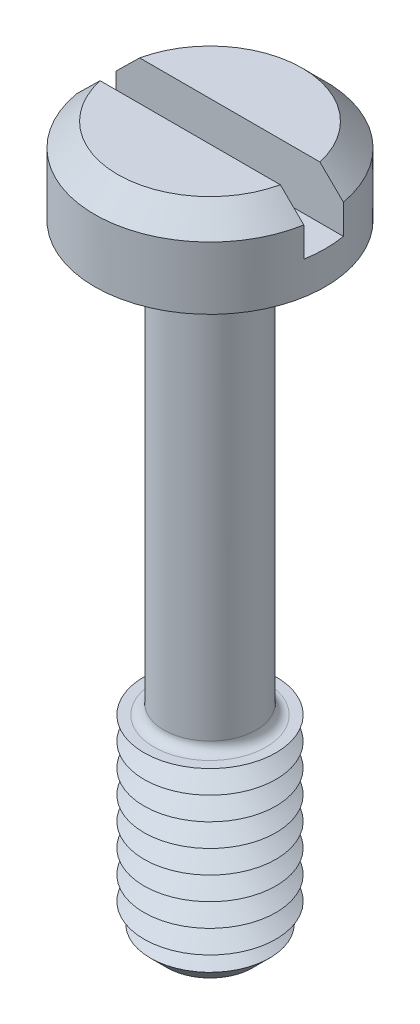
ISO-10303-21;
HEADER;
FILE_DESCRIPTION(('STEP AP214'),'2;1');
FILE_NAME('part.step','',(''),(''),'','','');
FILE_SCHEMA(('AUTOMOTIVE_DESIGN { 1 0 10303 214 1 1 1 1 }'));
ENDSEC;
DATA;
#1=APPLICATION_CONTEXT('core data for automotive mechanical design processes');
#2=APPLICATION_PROTOCOL_DEFINITION('international standard','automotive_design',2000,#1);
#3=PRODUCT_CONTEXT('',#1,'mechanical');
#4=PRODUCT('Part','Part','',(#3));
#5=PRODUCT_RELATED_PRODUCT_CATEGORY('part','',(#4));
#6=PRODUCT_DEFINITION_FORMATION('','',#4);
#7=PRODUCT_DEFINITION_CONTEXT('part definition',#1,'design');
#8=PRODUCT_DEFINITION('design','',#6,#7);
#9=PRODUCT_DEFINITION_SHAPE('','',#8);
#10=(LENGTH_UNIT() NAMED_UNIT(*) SI_UNIT(.MILLI.,.METRE.));
#11=(NAMED_UNIT(*) PLANE_ANGLE_UNIT() SI_UNIT($,.RADIAN.));
#12=(NAMED_UNIT(*) SI_UNIT($,.STERADIAN.) SOLID_ANGLE_UNIT());
#13=UNCERTAINTY_MEASURE_WITH_UNIT(LENGTH_MEASURE(1.E-05),#10,'distance_accuracy_value','');
#14=(GEOMETRIC_REPRESENTATION_CONTEXT(3) GLOBAL_UNCERTAINTY_ASSIGNED_CONTEXT((#13)) GLOBAL_UNIT_ASSIGNED_CONTEXT((#10,
#11,#12)) REPRESENTATION_CONTEXT('',''));
#15=CARTESIAN_POINT('',(0.,0.,0.));
#16=DIRECTION('',(0.,0.,1.));
#17=DIRECTION('',(1.,0.,0.));
#18=AXIS2_PLACEMENT_3D('',#15,#16,#17);
#19=CARTESIAN_POINT('',(0.,2.6,0.));
#20=DIRECTION('',(0.,1.,0.));
#21=DIRECTION('',(0.,0.,1.));
#22=AXIS2_PLACEMENT_3D('',#19,#20,#21);
#23=PLANE('',#22);
#24=DIRECTION('',(-1.,0.,0.));
#25=VECTOR('',#24,1.);
#26=CARTESIAN_POINT('',(3.5,2.6,-0.6));
#27=LINE('',#26,#25);
#28=CARTESIAN_POINT('',(2.73495886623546,2.6,-0.6));
#29=VERTEX_POINT('',#28);
#30=CARTESIAN_POINT('',(-2.73495886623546,2.6,-0.6));
#31=VERTEX_POINT('',#30);
#32=EDGE_CURVE('E110',#29,#31,#27,.T.);
#33=ORIENTED_EDGE('',*,*,#32,.F.);
#34=CARTESIAN_POINT('',(0.,2.6,0.));
#35=DIRECTION('',(0.,1.,0.));
#36=DIRECTION('',(0.,0.,1.));
#37=AXIS2_PLACEMENT_3D('',#34,#35,#36);
#38=CIRCLE('',#37,2.79999999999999);
#39=EDGE_CURVE('E113',#29,#31,#38,.T.);
#40=ORIENTED_EDGE('',*,*,#39,.T.);
#41=EDGE_LOOP('',(#33,#40));
#42=FACE_BOUND('',#41,.T.);
#43=ADVANCED_FACE('F39',(#42),#23,.T.);
#44=CARTESIAN_POINT('',(0.,2.6,0.));
#45=DIRECTION('',(0.,-1.,0.));
#46=DIRECTION('',(0.,0.,-1.));
#47=AXIS2_PLACEMENT_3D('',#44,#45,#46);
#48=CONICAL_SURFACE('',#47,2.79999999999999,0.785398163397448);
#49=CARTESIAN_POINT('',(7.69779986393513,-2.32114776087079,-0.6));
#50=CARTESIAN_POINT('',(7.42456340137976,-2.04874480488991,-0.6));
#51=CARTESIAN_POINT('',(7.15128998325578,-1.77637887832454,-0.6));
#52=CARTESIAN_POINT('',(6.60460779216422,-1.23176088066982,-0.6));
#53=CARTESIAN_POINT('',(6.33119901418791,-0.959508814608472,-0.6));
#54=CARTESIAN_POINT('',(5.78393918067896,-0.41491410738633,-0.6));
#55=CARTESIAN_POINT('',(5.51008795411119,-0.142571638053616,-0.6));
#56=CARTESIAN_POINT('',(4.9621249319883,0.401829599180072,-0.6));
#57=CARTESIAN_POINT('',(4.68801314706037,0.673888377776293,-0.6));
#58=CARTESIAN_POINT('',(4.15230810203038,1.204717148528,-0.6));
#59=CARTESIAN_POINT('',(3.89073524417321,1.4635077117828,-0.6));
#60=CARTESIAN_POINT('',(3.49781694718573,1.85115830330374,-0.6));
#61=CARTESIAN_POINT('',(3.36674319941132,1.98029362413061,-0.6));
#62=CARTESIAN_POINT('',(3.10433907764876,2.23830030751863,-0.6));
#63=CARTESIAN_POINT('',(2.97300870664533,2.36717167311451,-0.6));
#64=CARTESIAN_POINT('',(2.71005235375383,2.62445652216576,-0.6));
#65=CARTESIAN_POINT('',(2.57842659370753,2.75287023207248,-0.6));
#66=CARTESIAN_POINT('',(2.31459302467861,3.00911021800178,-0.6));
#67=CARTESIAN_POINT('',(2.1823851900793,3.13693646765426,-0.6));
#68=CARTESIAN_POINT('',(1.91706128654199,3.39159289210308,-0.6));
#69=CARTESIAN_POINT('',(1.78394541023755,3.51842326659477,-0.6));
#70=CARTESIAN_POINT('',(1.5829745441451,3.70728046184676,-0.6));
#71=CARTESIAN_POINT('',(1.51577053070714,3.76999922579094,-0.6));
#72=CARTESIAN_POINT('',(1.38073587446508,3.89475766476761,-0.6));
#73=CARTESIAN_POINT('',(1.31290524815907,3.95679735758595,-0.6));
#74=CARTESIAN_POINT('',(1.20662362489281,4.05253127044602,-0.6));
#75=CARTESIAN_POINT('',(1.16849592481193,4.08658409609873,-0.6));
#76=CARTESIAN_POINT('',(1.09186306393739,4.15427097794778,-0.6));
#77=CARTESIAN_POINT('',(1.05335786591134,4.18790499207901,-0.6));
#78=CARTESIAN_POINT('',(0.975560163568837,4.25487029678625,-0.6));
#79=CARTESIAN_POINT('',(0.936263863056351,4.28819718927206,-0.6));
#80=CARTESIAN_POINT('',(0.857023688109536,4.3540539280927,-0.6));
#81=CARTESIAN_POINT('',(0.817079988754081,4.38658398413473,-0.6));
#82=CARTESIAN_POINT('',(0.73593206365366,4.45080389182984,-0.6));
#83=CARTESIAN_POINT('',(0.694719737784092,4.48248357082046,-0.6));
#84=CARTESIAN_POINT('',(0.611023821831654,4.54411116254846,-0.6));
#85=CARTESIAN_POINT('',(0.568540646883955,4.5740596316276,-0.6));
#86=CARTESIAN_POINT('',(0.482031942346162,4.63104137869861,-0.6));
#87=CARTESIAN_POINT('',(0.438018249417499,4.65809235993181,-0.6));
#88=CARTESIAN_POINT('',(0.347545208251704,4.70764477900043,-0.6));
#89=CARTESIAN_POINT('',(0.301093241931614,4.73015905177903,-0.6));
#90=CARTESIAN_POINT('',(0.21684063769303,4.76288589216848,-0.6));
#91=CARTESIAN_POINT('',(0.179711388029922,4.77476119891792,-0.6));
#92=CARTESIAN_POINT('',(0.104069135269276,4.79214056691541,-0.6));
#93=CARTESIAN_POINT('',(0.0655630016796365,4.79767265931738,-0.6));
#94=CARTESIAN_POINT('',(-0.0121083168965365,4.80113734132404,-0.6));
#95=CARTESIAN_POINT('',(-0.051276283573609,4.7990121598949,-0.6));
#96=CARTESIAN_POINT('',(-0.128601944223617,4.78758103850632,-0.6));
#97=CARTESIAN_POINT('',(-0.166755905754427,4.77825158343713,-0.6));
#98=CARTESIAN_POINT('',(-0.239985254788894,4.75468984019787,-0.6));
#99=CARTESIAN_POINT('',(-0.275121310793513,4.74063623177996,-0.6));
#100=CARTESIAN_POINT('',(-0.343859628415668,4.70912771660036,-0.6));
#101=CARTESIAN_POINT('',(-0.377459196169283,4.69166709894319,-0.6));
#102=CARTESIAN_POINT('',(-0.443620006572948,4.65431398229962,-0.6));
#103=CARTESIAN_POINT('',(-0.476170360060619,4.63440256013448,-0.6));
#104=CARTESIAN_POINT('',(-0.540208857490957,4.5930114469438,-0.6));
#105=CARTESIAN_POINT('',(-0.571697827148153,4.57153301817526,-0.6));
#106=CARTESIAN_POINT('',(-0.63642661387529,4.52565712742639,-0.6));
#107=CARTESIAN_POINT('',(-0.669598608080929,4.50116466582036,-0.6));
#108=CARTESIAN_POINT('',(-0.735238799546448,4.4512509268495,-0.6));
#109=CARTESIAN_POINT('',(-0.767706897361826,4.4258295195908,-0.6));
#110=CARTESIAN_POINT('',(-0.864340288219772,4.34853769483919,-0.6));
#111=CARTESIAN_POINT('',(-0.927700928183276,4.29566444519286,-0.6));
#112=CARTESIAN_POINT('',(-1.05322030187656,4.18829389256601,-0.6));
#113=CARTESIAN_POINT('',(-1.11537654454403,4.13379371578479,-0.6));
#114=CARTESIAN_POINT('',(-1.23879800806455,4.02383276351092,-0.6));
#115=CARTESIAN_POINT('',(-1.30006349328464,3.96837228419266,-0.6));
#116=CARTESIAN_POINT('',(-1.42182653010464,3.85695373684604,-0.6));
#117=CARTESIAN_POINT('',(-1.48232573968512,3.8009974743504,-0.6));
#118=CARTESIAN_POINT('',(-1.60290045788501,3.68862177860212,-0.6));
#119=CARTESIAN_POINT('',(-1.66297593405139,3.63220231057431,-0.6));
#120=CARTESIAN_POINT('',(-1.84259490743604,3.46258196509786,-0.6));
#121=CARTESIAN_POINT('',(-1.96167258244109,3.34888831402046,-0.6));
#122=CARTESIAN_POINT('',(-2.19942862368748,3.12043467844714,-0.6));
#123=CARTESIAN_POINT('',(-2.31810499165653,3.00567262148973,-0.6));
#124=CARTESIAN_POINT('',(-2.55498513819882,2.77566147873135,-0.6));
#125=CARTESIAN_POINT('',(-2.67318891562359,2.66041239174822,-0.6));
#126=CARTESIAN_POINT('',(-3.0273377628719,2.31418176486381,-0.6));
#127=CARTESIAN_POINT('',(-3.26281496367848,2.08272206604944,-0.6));
#128=CARTESIAN_POINT('',(-3.73326607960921,1.6190281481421,-0.6));
#129=CARTESIAN_POINT('',(-3.96823963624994,1.38679356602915,-0.6));
#130=CARTESIAN_POINT('',(-4.43780370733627,0.921942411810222,-0.6));
#131=CARTESIAN_POINT('',(-4.67239422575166,0.689325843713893,-0.6));
#132=CARTESIAN_POINT('',(-5.13982382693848,0.225350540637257,-0.6));
#133=CARTESIAN_POINT('',(-5.37266445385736,-0.00600663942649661,-0.6));
#134=CARTESIAN_POINT('',(-5.83818541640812,-0.468883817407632,-0.6));
#135=CARTESIAN_POINT('',(-6.07086575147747,-0.700403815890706,-0.6));
#136=CARTESIAN_POINT('',(-6.53596926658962,-1.16341429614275,-0.6));
#137=CARTESIAN_POINT('',(-6.76839251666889,-1.39490470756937,-0.6));
#138=CARTESIAN_POINT('',(-7.23315324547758,-1.85796986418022,-0.6));
#139=CARTESIAN_POINT('',(-7.46549072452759,-2.08954460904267,-0.6));
#140=CARTESIAN_POINT('',(-7.69779986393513,-2.32114776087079,-0.6));
#141=B_SPLINE_CURVE_WITH_KNOTS('',3,(#49,#50,#51,#52,#53,#54,#55,#56,#57,#58,#59,#60,#61,#62,
#63,#64,#65,#66,#67,#68,#69,#70,#71,#72,#73,#74,#75,#76,#77,#78,#79,#80,#81,#82,#83,#84,#85,#86,
#87,#88,#89,#90,#91,#92,#93,#94,#95,#96,#97,#98,#99,#100,#101,#102,#103,#104,#105,#106,#107,
#108,#109,#110,#111,#112,#113,#114,#115,#116,#117,#118,#119,#120,#121,#122,#123,#124,#125,#126,
#127,#128,#129,#130,#131,#132,#133,#134,#135,#136,#137,#138,#139,#140),.UNSPECIFIED.,.F.,.F.,(4,
2,2,2,2,2,2,2,2,2,2,2,2,2,2,2,2,2,2,2,2,2,2,2,2,2,2,2,2,2,2,2,2,2,2,2,2,2,2,2,2,2,2,2,2,4),(0.,
1.15747738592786,2.31500139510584,3.4736574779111,4.63226817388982,5.73614050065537,
6.28814234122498,6.84013779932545,7.39180548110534,7.94349768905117,8.49507629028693,
8.77084567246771,9.04660781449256,9.19996738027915,9.35334222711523,9.50791164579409,
9.66243993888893,9.81835637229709,9.9742224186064,10.1290741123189,10.2834813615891,
10.4000294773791,10.5160605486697,10.6329688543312,10.7502603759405,10.8635386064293,
10.9770083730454,11.0914168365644,11.205734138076,11.3294140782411,11.4531113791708,
11.7006314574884,11.9486181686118,12.1965297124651,12.4437540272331,12.6909970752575,
13.184904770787,13.6801705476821,14.1754375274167,15.1659939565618,16.1571087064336,
17.1482131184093,18.1329303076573,19.1176509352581,20.1017623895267,21.0858701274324),.UNSPECIFIED.);
#142=CARTESIAN_POINT('',(3.44818792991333,1.89999999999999,-0.6));
#143=VERTEX_POINT('',#142);
#144=EDGE_CURVE('E260',#143,#29,#141,.T.);
#145=ORIENTED_EDGE('',*,*,#144,.F.);
#146=CARTESIAN_POINT('',(0.,1.89999999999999,0.));
#147=DIRECTION('',(0.,1.,0.));
#148=DIRECTION('',(0.,0.,1.));
#149=AXIS2_PLACEMENT_3D('',#146,#147,#148);
#150=CIRCLE('',#149,3.5);
#151=CARTESIAN_POINT('',(-3.44818792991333,1.89999999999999,-0.6));
#152=VERTEX_POINT('',#151);
#153=EDGE_CURVE('E128',#152,#143,#150,.F.);
#154=ORIENTED_EDGE('',*,*,#153,.F.);
#155=EDGE_CURVE('E102',#31,#152,#141,.T.);
#156=ORIENTED_EDGE('',*,*,#155,.F.);
#157=ORIENTED_EDGE('',*,*,#39,.F.);
#158=EDGE_LOOP('',(#145,#154,#156,#157));
#159=FACE_BOUND('',#158,.T.);
#160=ADVANCED_FACE('F222',(#159),#48,.T.);
#161=CARTESIAN_POINT('',(0.,-19.,0.));
#162=DIRECTION('',(0.,1.,0.));
#163=DIRECTION('',(0.,0.,1.));
#164=AXIS2_PLACEMENT_3D('',#161,#162,#163);
#165=CYLINDRICAL_SURFACE('',#164,1.4);
#166=CARTESIAN_POINT('',(0.,-12.7,0.));
#167=DIRECTION('',(0.,-1.,0.));
#168=DIRECTION('',(0.,0.,-1.));
#169=AXIS2_PLACEMENT_3D('',#166,#167,#168);
#170=CIRCLE('',#169,1.4);
#171=CARTESIAN_POINT('',(0.,-12.7,-1.4));
#172=VERTEX_POINT('',#171);
#173=EDGE_CURVE('E123',#172,#172,#170,.F.);
#174=ORIENTED_EDGE('',*,*,#173,.T.);
#175=EDGE_LOOP('',(#174));
#176=FACE_BOUND('',#175,.T.);
#177=CARTESIAN_POINT('',(0.,-0.300000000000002,0.));
#178=DIRECTION('',(0.,1.,0.));
#179=DIRECTION('',(0.,0.,1.));
#180=AXIS2_PLACEMENT_3D('',#177,#178,#179);
#181=CIRCLE('',#180,1.4);
#182=CARTESIAN_POINT('',(0.,-0.300000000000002,1.4));
#183=VERTEX_POINT('',#182);
#184=EDGE_CURVE('E366',#183,#183,#181,.F.);
#185=ORIENTED_EDGE('',*,*,#184,.T.);
#186=EDGE_LOOP('',(#185));
#187=FACE_BOUND('',#186,.T.);
#188=ADVANCED_FACE('F218',(#176,#187),#165,.T.);
#189=CARTESIAN_POINT('',(0.,2.6,0.));
#190=DIRECTION('',(0.,-1.,0.));
#191=DIRECTION('',(0.,0.,-1.));
#192=AXIS2_PLACEMENT_3D('',#189,#190,#191);
#193=CYLINDRICAL_SURFACE('',#192,3.5);
#194=ORIENTED_EDGE('',*,*,#153,.T.);
#195=DIRECTION('',(0.,-1.,0.));
#196=VECTOR('',#195,1.);
#197=CARTESIAN_POINT('',(3.44818792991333,2.6,-0.6));
#198=LINE('',#197,#196);
#199=CARTESIAN_POINT('',(3.44818792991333,1.,-0.6));
#200=VERTEX_POINT('',#199);
#201=EDGE_CURVE('E64',#143,#200,#198,.T.);
#202=ORIENTED_EDGE('',*,*,#201,.T.);
#203=CARTESIAN_POINT('',(0.,1.,0.));
#204=DIRECTION('',(0.,1.,0.));
#205=DIRECTION('',(0.,0.,1.));
#206=AXIS2_PLACEMENT_3D('',#203,#204,#205);
#207=CIRCLE('',#206,3.5);
#208=CARTESIAN_POINT('',(3.44818792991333,1.,0.6));
#209=VERTEX_POINT('',#208);
#210=EDGE_CURVE('E11',#209,#200,#207,.T.);
#211=ORIENTED_EDGE('',*,*,#210,.F.);
#212=DIRECTION('',(0.,-1.,0.));
#213=VECTOR('',#212,1.);
#214=CARTESIAN_POINT('',(3.44818792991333,2.6,0.6));
#215=LINE('',#214,#213);
#216=CARTESIAN_POINT('',(3.44818792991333,1.89999999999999,0.6));
#217=VERTEX_POINT('',#216);
#218=EDGE_CURVE('E279',#209,#217,#215,.F.);
#219=ORIENTED_EDGE('',*,*,#218,.T.);
#220=CARTESIAN_POINT('',(-3.44818792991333,1.89999999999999,0.6));
#221=VERTEX_POINT('',#220);
#222=EDGE_CURVE('E120',#217,#221,#150,.F.);
#223=ORIENTED_EDGE('',*,*,#222,.T.);
#224=DIRECTION('',(0.,-1.,0.));
#225=VECTOR('',#224,1.);
#226=CARTESIAN_POINT('',(-3.44818792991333,2.6,0.6));
#227=LINE('',#226,#225);
#228=CARTESIAN_POINT('',(-3.44818792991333,1.,0.6));
#229=VERTEX_POINT('',#228);
#230=EDGE_CURVE('E96',#221,#229,#227,.T.);
#231=ORIENTED_EDGE('',*,*,#230,.T.);
#232=CARTESIAN_POINT('',(-3.44818792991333,1.,-0.6));
#233=VERTEX_POINT('',#232);
#234=EDGE_CURVE('E44',#233,#229,#207,.T.);
#235=ORIENTED_EDGE('',*,*,#234,.F.);
#236=DIRECTION('',(0.,-1.,0.));
#237=VECTOR('',#236,1.);
#238=CARTESIAN_POINT('',(-3.44818792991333,2.6,-0.6));
#239=LINE('',#238,#237);
#240=EDGE_CURVE('E283',#233,#152,#239,.F.);
#241=ORIENTED_EDGE('',*,*,#240,.T.);
#242=EDGE_LOOP('',(#194,#202,#211,#219,#223,#231,#235,#241));
#243=FACE_BOUND('',#242,.T.);
#244=CARTESIAN_POINT('',(0.,0.,0.));
#245=DIRECTION('',(0.,1.,0.));
#246=DIRECTION('',(0.,0.,1.));
#247=AXIS2_PLACEMENT_3D('',#244,#245,#246);
#248=CIRCLE('',#247,3.5);
#249=CARTESIAN_POINT('',(0.,0.,3.5));
#250=VERTEX_POINT('',#249);
#251=EDGE_CURVE('E353',#250,#250,#248,.T.);
#252=ORIENTED_EDGE('',*,*,#251,.T.);
#253=EDGE_LOOP('',(#252));
#254=FACE_BOUND('',#253,.T.);
#255=ADVANCED_FACE('F221',(#243,#254),#193,.T.);
#256=DIRECTION('',(1.,0.,0.));
#257=VECTOR('',#256,1.);
#258=CARTESIAN_POINT('',(3.5,2.6,0.6));
#259=LINE('',#258,#257);
#260=CARTESIAN_POINT('',(-2.73495886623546,2.6,0.6));
#261=VERTEX_POINT('',#260);
#262=CARTESIAN_POINT('',(2.73495886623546,2.6,0.6));
#263=VERTEX_POINT('',#262);
#264=EDGE_CURVE('E56',#261,#263,#259,.T.);
#265=ORIENTED_EDGE('',*,*,#264,.F.);
#266=EDGE_CURVE('E108',#261,#263,#38,.T.);
#267=ORIENTED_EDGE('',*,*,#266,.T.);
#268=EDGE_LOOP('',(#265,#267));
#269=FACE_BOUND('',#268,.T.);
#270=ADVANCED_FACE('F107',(#269),#23,.T.);
#271=CARTESIAN_POINT('',(0.,0.,0.));
#272=DIRECTION('',(0.,1.,0.));
#273=DIRECTION('',(0.,0.,1.));
#274=AXIS2_PLACEMENT_3D('',#271,#272,#273);
#275=PLANE('',#274);
#276=CARTESIAN_POINT('',(0.,0.,0.));
#277=DIRECTION('',(0.,1.,0.));
#278=DIRECTION('',(0.,0.,1.));
#279=AXIS2_PLACEMENT_3D('',#276,#277,#278);
#280=CIRCLE('',#279,1.7);
#281=CARTESIAN_POINT('',(0.,0.,1.7));
#282=VERTEX_POINT('',#281);
#283=EDGE_CURVE('E114',#282,#282,#280,.T.);
#284=ORIENTED_EDGE('',*,*,#283,.T.);
#285=EDGE_LOOP('',(#284));
#286=FACE_BOUND('',#285,.T.);
#287=ORIENTED_EDGE('',*,*,#251,.F.);
#288=EDGE_LOOP('',(#287));
#289=FACE_BOUND('',#288,.T.);
#290=ADVANCED_FACE('F212',(#286,#289),#275,.F.);
#291=CARTESIAN_POINT('',(0.,-13.,0.));
#292=DIRECTION('',(0.,-1.,0.));
#293=DIRECTION('',(0.,0.,-1.));
#294=AXIS2_PLACEMENT_3D('',#291,#292,#293);
#295=PLANE('',#294);
#296=CARTESIAN_POINT('',(0.,-13.,0.));
#297=DIRECTION('',(0.,-1.,0.));
#298=DIRECTION('',(0.,0.,-1.));
#299=AXIS2_PLACEMENT_3D('',#296,#297,#298);
#300=CIRCLE('',#299,1.7);
#301=CARTESIAN_POINT('',(0.,-13.,-1.7));
#302=VERTEX_POINT('',#301);
#303=EDGE_CURVE('E360',#302,#302,#300,.T.);
#304=ORIENTED_EDGE('',*,*,#303,.T.);
#305=EDGE_LOOP('',(#304));
#306=FACE_BOUND('',#305,.T.);
#307=CARTESIAN_POINT('',(0.,-13.,0.));
#308=DIRECTION('',(0.,1.,0.));
#309=DIRECTION('',(0.,0.,1.));
#310=AXIS2_PLACEMENT_3D('',#307,#308,#309);
#311=CIRCLE('',#310,2.);
#312=CARTESIAN_POINT('',(0.,-13.,2.));
#313=VERTEX_POINT('',#312);
#314=EDGE_CURVE('E349',#313,#313,#311,.T.);
#315=ORIENTED_EDGE('',*,*,#314,.T.);
#316=EDGE_LOOP('',(#315));
#317=FACE_BOUND('',#316,.T.);
#318=ADVANCED_FACE('F208',(#306,#317),#295,.F.);
#319=CARTESIAN_POINT('',(0.,-13.35,0.));
#320=DIRECTION('',(0.,1.,0.));
#321=DIRECTION('',(0.,0.,1.));
#322=AXIS2_PLACEMENT_3D('',#319,#320,#321);
#323=CONICAL_SURFACE('',#322,1.39378221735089,1.0471975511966);
#324=ORIENTED_EDGE('',*,*,#314,.F.);
#325=EDGE_LOOP('',(#324));
#326=FACE_BOUND('',#325,.T.);
#327=CARTESIAN_POINT('',(0.,-13.35,0.));
#328=DIRECTION('',(0.,1.,0.));
#329=DIRECTION('',(0.,0.,1.));
#330=AXIS2_PLACEMENT_3D('',#327,#328,#329);
#331=CIRCLE('',#330,1.39378221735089);
#332=CARTESIAN_POINT('',(0.,-13.35,1.39378221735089));
#333=VERTEX_POINT('',#332);
#334=EDGE_CURVE('E346',#333,#333,#331,.T.);
#335=ORIENTED_EDGE('',*,*,#334,.T.);
#336=EDGE_LOOP('',(#335));
#337=FACE_BOUND('',#336,.T.);
#338=ADVANCED_FACE('F204',(#326,#337),#323,.T.);
#339=CARTESIAN_POINT('',(0.,-13.7,0.));
#340=DIRECTION('',(0.,-1.,0.));
#341=DIRECTION('',(0.,0.,-1.));
#342=AXIS2_PLACEMENT_3D('',#339,#340,#341);
#343=CONICAL_SURFACE('',#342,2.,1.0471975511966);
#344=ORIENTED_EDGE('',*,*,#334,.F.);
#345=EDGE_LOOP('',(#344));
#346=FACE_BOUND('',#345,.T.);
#347=CARTESIAN_POINT('',(0.,-13.7,0.));
#348=DIRECTION('',(0.,1.,0.));
#349=DIRECTION('',(0.,0.,1.));
#350=AXIS2_PLACEMENT_3D('',#347,#348,#349);
#351=CIRCLE('',#350,2.);
#352=CARTESIAN_POINT('',(0.,-13.7,2.));
#353=VERTEX_POINT('',#352);
#354=EDGE_CURVE('E342',#353,#353,#351,.T.);
#355=ORIENTED_EDGE('',*,*,#354,.T.);
#356=EDGE_LOOP('',(#355));
#357=FACE_BOUND('',#356,.T.);
#358=ADVANCED_FACE('F200',(#346,#357),#343,.T.);
#359=CARTESIAN_POINT('',(0.,-14.05,0.));
#360=DIRECTION('',(0.,1.,0.));
#361=DIRECTION('',(0.,0.,1.));
#362=AXIS2_PLACEMENT_3D('',#359,#360,#361);
#363=CONICAL_SURFACE('',#362,1.39378221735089,1.0471975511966);
#364=ORIENTED_EDGE('',*,*,#354,.F.);
#365=EDGE_LOOP('',(#364));
#366=FACE_BOUND('',#365,.T.);
#367=CARTESIAN_POINT('',(0.,-14.05,0.));
#368=DIRECTION('',(0.,1.,0.));
#369=DIRECTION('',(0.,0.,1.));
#370=AXIS2_PLACEMENT_3D('',#367,#368,#369);
#371=CIRCLE('',#370,1.39378221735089);
#372=CARTESIAN_POINT('',(0.,-14.05,1.39378221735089));
#373=VERTEX_POINT('',#372);
#374=EDGE_CURVE('E338',#373,#373,#371,.T.);
#375=ORIENTED_EDGE('',*,*,#374,.T.);
#376=EDGE_LOOP('',(#375));
#377=FACE_BOUND('',#376,.T.);
#378=ADVANCED_FACE('F196',(#366,#377),#363,.T.);
#379=CARTESIAN_POINT('',(0.,-14.4,0.));
#380=DIRECTION('',(0.,-1.,0.));
#381=DIRECTION('',(0.,0.,-1.));
#382=AXIS2_PLACEMENT_3D('',#379,#380,#381);
#383=CONICAL_SURFACE('',#382,2.,1.0471975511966);
#384=ORIENTED_EDGE('',*,*,#374,.F.);
#385=EDGE_LOOP('',(#384));
#386=FACE_BOUND('',#385,.T.);
#387=CARTESIAN_POINT('',(0.,-14.4,0.));
#388=DIRECTION('',(0.,1.,0.));
#389=DIRECTION('',(0.,0.,1.));
#390=AXIS2_PLACEMENT_3D('',#387,#388,#389);
#391=CIRCLE('',#390,2.);
#392=CARTESIAN_POINT('',(0.,-14.4,2.));
#393=VERTEX_POINT('',#392);
#394=EDGE_CURVE('E334',#393,#393,#391,.T.);
#395=ORIENTED_EDGE('',*,*,#394,.T.);
#396=EDGE_LOOP('',(#395));
#397=FACE_BOUND('',#396,.T.);
#398=ADVANCED_FACE('F192',(#386,#397),#383,.T.);
#399=CARTESIAN_POINT('',(0.,-14.75,0.));
#400=DIRECTION('',(0.,1.,0.));
#401=DIRECTION('',(0.,0.,1.));
#402=AXIS2_PLACEMENT_3D('',#399,#400,#401);
#403=CONICAL_SURFACE('',#402,1.39378221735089,1.0471975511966);
#404=ORIENTED_EDGE('',*,*,#394,.F.);
#405=EDGE_LOOP('',(#404));
#406=FACE_BOUND('',#405,.T.);
#407=CARTESIAN_POINT('',(0.,-14.75,0.));
#408=DIRECTION('',(0.,1.,0.));
#409=DIRECTION('',(0.,0.,1.));
#410=AXIS2_PLACEMENT_3D('',#407,#408,#409);
#411=CIRCLE('',#410,1.39378221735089);
#412=CARTESIAN_POINT('',(0.,-14.75,1.39378221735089));
#413=VERTEX_POINT('',#412);
#414=EDGE_CURVE('E330',#413,#413,#411,.T.);
#415=ORIENTED_EDGE('',*,*,#414,.T.);
#416=EDGE_LOOP('',(#415));
#417=FACE_BOUND('',#416,.T.);
#418=ADVANCED_FACE('F188',(#406,#417),#403,.T.);
#419=CARTESIAN_POINT('',(0.,-15.1,0.));
#420=DIRECTION('',(0.,-1.,0.));
#421=DIRECTION('',(0.,0.,-1.));
#422=AXIS2_PLACEMENT_3D('',#419,#420,#421);
#423=CONICAL_SURFACE('',#422,2.,1.0471975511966);
#424=ORIENTED_EDGE('',*,*,#414,.F.);
#425=EDGE_LOOP('',(#424));
#426=FACE_BOUND('',#425,.T.);
#427=CARTESIAN_POINT('',(0.,-15.1,0.));
#428=DIRECTION('',(0.,1.,0.));
#429=DIRECTION('',(0.,0.,1.));
#430=AXIS2_PLACEMENT_3D('',#427,#428,#429);
#431=CIRCLE('',#430,2.);
#432=CARTESIAN_POINT('',(0.,-15.1,2.));
#433=VERTEX_POINT('',#432);
#434=EDGE_CURVE('E326',#433,#433,#431,.T.);
#435=ORIENTED_EDGE('',*,*,#434,.T.);
#436=EDGE_LOOP('',(#435));
#437=FACE_BOUND('',#436,.T.);
#438=ADVANCED_FACE('F184',(#426,#437),#423,.T.);
#439=CARTESIAN_POINT('',(0.,-15.45,0.));
#440=DIRECTION('',(0.,1.,0.));
#441=DIRECTION('',(0.,0.,1.));
#442=AXIS2_PLACEMENT_3D('',#439,#440,#441);
#443=CONICAL_SURFACE('',#442,1.39378221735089,1.0471975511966);
#444=ORIENTED_EDGE('',*,*,#434,.F.);
#445=EDGE_LOOP('',(#444));
#446=FACE_BOUND('',#445,.T.);
#447=CARTESIAN_POINT('',(0.,-15.45,0.));
#448=DIRECTION('',(0.,1.,0.));
#449=DIRECTION('',(0.,0.,1.));
#450=AXIS2_PLACEMENT_3D('',#447,#448,#449);
#451=CIRCLE('',#450,1.39378221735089);
#452=CARTESIAN_POINT('',(0.,-15.45,1.39378221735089));
#453=VERTEX_POINT('',#452);
#454=EDGE_CURVE('E323',#453,#453,#451,.T.);
#455=ORIENTED_EDGE('',*,*,#454,.T.);
#456=EDGE_LOOP('',(#455));
#457=FACE_BOUND('',#456,.T.);
#458=ADVANCED_FACE('F180',(#446,#457),#443,.T.);
#459=CARTESIAN_POINT('',(0.,-15.8,0.));
#460=DIRECTION('',(0.,-1.,0.));
#461=DIRECTION('',(0.,0.,-1.));
#462=AXIS2_PLACEMENT_3D('',#459,#460,#461);
#463=CONICAL_SURFACE('',#462,2.,1.0471975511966);
#464=ORIENTED_EDGE('',*,*,#454,.F.);
#465=EDGE_LOOP('',(#464));
#466=FACE_BOUND('',#465,.T.);
#467=CARTESIAN_POINT('',(0.,-15.8,0.));
#468=DIRECTION('',(0.,1.,0.));
#469=DIRECTION('',(0.,0.,1.));
#470=AXIS2_PLACEMENT_3D('',#467,#468,#469);
#471=CIRCLE('',#470,2.);
#472=CARTESIAN_POINT('',(0.,-15.8,2.));
#473=VERTEX_POINT('',#472);
#474=EDGE_CURVE('E319',#473,#473,#471,.T.);
#475=ORIENTED_EDGE('',*,*,#474,.T.);
#476=EDGE_LOOP('',(#475));
#477=FACE_BOUND('',#476,.T.);
#478=ADVANCED_FACE('F176',(#466,#477),#463,.T.);
#479=CARTESIAN_POINT('',(0.,-16.15,0.));
#480=DIRECTION('',(0.,1.,0.));
#481=DIRECTION('',(0.,0.,1.));
#482=AXIS2_PLACEMENT_3D('',#479,#480,#481);
#483=CONICAL_SURFACE('',#482,1.39378221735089,1.0471975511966);
#484=ORIENTED_EDGE('',*,*,#474,.F.);
#485=EDGE_LOOP('',(#484));
#486=FACE_BOUND('',#485,.T.);
#487=CARTESIAN_POINT('',(0.,-16.15,0.));
#488=DIRECTION('',(0.,1.,0.));
#489=DIRECTION('',(0.,0.,1.));
#490=AXIS2_PLACEMENT_3D('',#487,#488,#489);
#491=CIRCLE('',#490,1.39378221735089);
#492=CARTESIAN_POINT('',(0.,-16.15,1.39378221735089));
#493=VERTEX_POINT('',#492);
#494=EDGE_CURVE('E315',#493,#493,#491,.T.);
#495=ORIENTED_EDGE('',*,*,#494,.T.);
#496=EDGE_LOOP('',(#495));
#497=FACE_BOUND('',#496,.T.);
#498=ADVANCED_FACE('F172',(#486,#497),#483,.T.);
#499=CARTESIAN_POINT('',(0.,-16.5,0.));
#500=DIRECTION('',(0.,-1.,0.));
#501=DIRECTION('',(0.,0.,-1.));
#502=AXIS2_PLACEMENT_3D('',#499,#500,#501);
#503=CONICAL_SURFACE('',#502,2.,1.0471975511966);
#504=ORIENTED_EDGE('',*,*,#494,.F.);
#505=EDGE_LOOP('',(#504));
#506=FACE_BOUND('',#505,.T.);
#507=CARTESIAN_POINT('',(0.,-16.5,0.));
#508=DIRECTION('',(0.,1.,0.));
#509=DIRECTION('',(0.,0.,1.));
#510=AXIS2_PLACEMENT_3D('',#507,#508,#509);
#511=CIRCLE('',#510,2.);
#512=CARTESIAN_POINT('',(0.,-16.5,2.));
#513=VERTEX_POINT('',#512);
#514=EDGE_CURVE('E312',#513,#513,#511,.T.);
#515=ORIENTED_EDGE('',*,*,#514,.T.);
#516=EDGE_LOOP('',(#515));
#517=FACE_BOUND('',#516,.T.);
#518=ADVANCED_FACE('F168',(#506,#517),#503,.T.);
#519=CARTESIAN_POINT('',(0.,-16.85,0.));
#520=DIRECTION('',(0.,1.,0.));
#521=DIRECTION('',(0.,0.,1.));
#522=AXIS2_PLACEMENT_3D('',#519,#520,#521);
#523=CONICAL_SURFACE('',#522,1.39378221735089,1.0471975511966);
#524=ORIENTED_EDGE('',*,*,#514,.F.);
#525=EDGE_LOOP('',(#524));
#526=FACE_BOUND('',#525,.T.);
#527=CARTESIAN_POINT('',(0.,-16.85,0.));
#528=DIRECTION('',(0.,1.,0.));
#529=DIRECTION('',(0.,0.,1.));
#530=AXIS2_PLACEMENT_3D('',#527,#528,#529);
#531=CIRCLE('',#530,1.39378221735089);
#532=CARTESIAN_POINT('',(0.,-16.85,1.39378221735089));
#533=VERTEX_POINT('',#532);
#534=EDGE_CURVE('E308',#533,#533,#531,.T.);
#535=ORIENTED_EDGE('',*,*,#534,.T.);
#536=EDGE_LOOP('',(#535));
#537=FACE_BOUND('',#536,.T.);
#538=ADVANCED_FACE('F164',(#526,#537),#523,.T.);
#539=CARTESIAN_POINT('',(0.,-17.2,0.));
#540=DIRECTION('',(0.,-1.,0.));
#541=DIRECTION('',(0.,0.,-1.));
#542=AXIS2_PLACEMENT_3D('',#539,#540,#541);
#543=CONICAL_SURFACE('',#542,2.,1.0471975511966);
#544=ORIENTED_EDGE('',*,*,#534,.F.);
#545=EDGE_LOOP('',(#544));
#546=FACE_BOUND('',#545,.T.);
#547=CARTESIAN_POINT('',(0.,-17.2,0.));
#548=DIRECTION('',(0.,1.,0.));
#549=DIRECTION('',(0.,0.,1.));
#550=AXIS2_PLACEMENT_3D('',#547,#548,#549);
#551=CIRCLE('',#550,2.);
#552=CARTESIAN_POINT('',(0.,-17.2,2.));
#553=VERTEX_POINT('',#552);
#554=EDGE_CURVE('E305',#553,#553,#551,.T.);
#555=ORIENTED_EDGE('',*,*,#554,.T.);
#556=EDGE_LOOP('',(#555));
#557=FACE_BOUND('',#556,.T.);
#558=ADVANCED_FACE('F160',(#546,#557),#543,.T.);
#559=CARTESIAN_POINT('',(0.,-17.55,0.));
#560=DIRECTION('',(0.,1.,0.));
#561=DIRECTION('',(0.,0.,1.));
#562=AXIS2_PLACEMENT_3D('',#559,#560,#561);
#563=CONICAL_SURFACE('',#562,1.39378221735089,1.0471975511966);
#564=ORIENTED_EDGE('',*,*,#554,.F.);
#565=EDGE_LOOP('',(#564));
#566=FACE_BOUND('',#565,.T.);
#567=CARTESIAN_POINT('',(0.,-17.55,0.));
#568=DIRECTION('',(0.,1.,0.));
#569=DIRECTION('',(0.,0.,1.));
#570=AXIS2_PLACEMENT_3D('',#567,#568,#569);
#571=CIRCLE('',#570,1.39378221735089);
#572=CARTESIAN_POINT('',(0.,-17.55,1.39378221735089));
#573=VERTEX_POINT('',#572);
#574=EDGE_CURVE('E301',#573,#573,#571,.T.);
#575=ORIENTED_EDGE('',*,*,#574,.T.);
#576=EDGE_LOOP('',(#575));
#577=FACE_BOUND('',#576,.T.);
#578=ADVANCED_FACE('F156',(#566,#577),#563,.T.);
#579=CARTESIAN_POINT('',(0.,-17.9,0.));
#580=DIRECTION('',(0.,-1.,0.));
#581=DIRECTION('',(0.,0.,-1.));
#582=AXIS2_PLACEMENT_3D('',#579,#580,#581);
#583=CONICAL_SURFACE('',#582,2.,1.0471975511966);
#584=ORIENTED_EDGE('',*,*,#574,.F.);
#585=EDGE_LOOP('',(#584));
#586=FACE_BOUND('',#585,.T.);
#587=CARTESIAN_POINT('',(0.,-17.9,0.));
#588=DIRECTION('',(0.,1.,0.));
#589=DIRECTION('',(0.,0.,1.));
#590=AXIS2_PLACEMENT_3D('',#587,#588,#589);
#591=CIRCLE('',#590,2.);
#592=CARTESIAN_POINT('',(0.,-17.9,2.));
#593=VERTEX_POINT('',#592);
#594=EDGE_CURVE('E296',#593,#593,#591,.T.);
#595=ORIENTED_EDGE('',*,*,#594,.T.);
#596=EDGE_LOOP('',(#595));
#597=FACE_BOUND('',#596,.T.);
#598=ADVANCED_FACE('F152',(#586,#597),#583,.T.);
#599=CARTESIAN_POINT('',(0.,-18.25,0.));
#600=DIRECTION('',(0.,1.,0.));
#601=DIRECTION('',(0.,0.,1.));
#602=AXIS2_PLACEMENT_3D('',#599,#600,#601);
#603=CONICAL_SURFACE('',#602,1.39378221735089,1.0471975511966);
#604=ORIENTED_EDGE('',*,*,#594,.F.);
#605=EDGE_LOOP('',(#604));
#606=FACE_BOUND('',#605,.T.);
#607=CARTESIAN_POINT('',(0.,-18.25,0.));
#608=DIRECTION('',(0.,1.,0.));
#609=DIRECTION('',(0.,0.,1.));
#610=AXIS2_PLACEMENT_3D('',#607,#608,#609);
#611=CIRCLE('',#610,1.39378221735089);
#612=CARTESIAN_POINT('',(0.,-18.25,1.39378221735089));
#613=VERTEX_POINT('',#612);
#614=EDGE_CURVE('E293',#613,#613,#611,.T.);
#615=ORIENTED_EDGE('',*,*,#614,.T.);
#616=EDGE_LOOP('',(#615));
#617=FACE_BOUND('',#616,.T.);
#618=ADVANCED_FACE('F148',(#606,#617),#603,.T.);
#619=CARTESIAN_POINT('',(0.,-18.6,0.));
#620=DIRECTION('',(0.,-1.,0.));
#621=DIRECTION('',(0.,0.,-1.));
#622=AXIS2_PLACEMENT_3D('',#619,#620,#621);
#623=CONICAL_SURFACE('',#622,2.,1.0471975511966);
#624=CARTESIAN_POINT('',(0.,-18.4901923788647,0.));
#625=DIRECTION('',(0.,-1.,0.));
#626=DIRECTION('',(0.,0.,-1.));
#627=AXIS2_PLACEMENT_3D('',#624,#625,#626);
#628=CIRCLE('',#627,1.80980762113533);
#629=CARTESIAN_POINT('',(0.,-18.4901923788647,1.80980762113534));
#630=VERTEX_POINT('',#629);
#631=EDGE_CURVE('E300',#630,#630,#628,.F.);
#632=ORIENTED_EDGE('',*,*,#631,.T.);
#633=EDGE_LOOP('',(#632));
#634=FACE_BOUND('',#633,.T.);
#635=ORIENTED_EDGE('',*,*,#614,.F.);
#636=EDGE_LOOP('',(#635));
#637=FACE_BOUND('',#636,.T.);
#638=ADVANCED_FACE('F144',(#634,#637),#623,.T.);
#639=CARTESIAN_POINT('',(0.,-19.,0.));
#640=DIRECTION('',(0.,-1.,0.));
#641=DIRECTION('',(0.,0.,-1.));
#642=AXIS2_PLACEMENT_3D('',#639,#640,#641);
#643=PLANE('',#642);
#644=CARTESIAN_POINT('',(0.,-19.,0.));
#645=DIRECTION('',(0.,-1.,0.));
#646=DIRECTION('',(0.,0.,-1.));
#647=AXIS2_PLACEMENT_3D('',#644,#645,#646);
#648=CIRCLE('',#647,1.30000000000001);
#649=CARTESIAN_POINT('',(0.,-19.,1.30000000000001));
#650=VERTEX_POINT('',#649);
#651=EDGE_CURVE('E356',#650,#650,#648,.T.);
#652=ORIENTED_EDGE('',*,*,#651,.T.);
#653=EDGE_LOOP('',(#652));
#654=FACE_BOUND('',#653,.T.);
#655=ADVANCED_FACE('F147',(#654),#643,.T.);
#656=CARTESIAN_POINT('',(0.,-19.,0.));
#657=DIRECTION('',(0.,1.,0.));
#658=DIRECTION('',(0.,0.,1.));
#659=AXIS2_PLACEMENT_3D('',#656,#657,#658);
#660=CONICAL_SURFACE('',#659,1.30000000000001,0.785398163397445);
#661=CARTESIAN_POINT('',(0.,-18.4901923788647,1.80980762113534));
#662=CARTESIAN_POINT('',(0.,-18.4955028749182,1.80449712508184));
#663=CARTESIAN_POINT('',(0.,-18.5008133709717,1.79918662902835));
#664=CARTESIAN_POINT('',(0.,-18.5114343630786,1.78856563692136));
#665=CARTESIAN_POINT('',(0.,-18.5167448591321,1.78325514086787));
#666=CARTESIAN_POINT('',(0.,-18.5273658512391,1.77263414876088));
#667=CARTESIAN_POINT('',(0.,-18.5326763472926,1.76732365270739));
#668=CARTESIAN_POINT('',(0.,-18.5432973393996,1.75670266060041));
#669=CARTESIAN_POINT('',(0.,-18.5486078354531,1.75139216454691));
#670=CARTESIAN_POINT('',(0.,-18.5592288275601,1.74077117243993));
#671=CARTESIAN_POINT('',(0.,-18.5645393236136,1.73546067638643));
#672=CARTESIAN_POINT('',(0.,-18.5751603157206,1.72483968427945));
#673=CARTESIAN_POINT('',(0.,-18.580470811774,1.71952918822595));
#674=CARTESIAN_POINT('',(0.,-18.591091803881,1.70890819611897));
#675=CARTESIAN_POINT('',(0.,-18.5964022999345,1.70359770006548));
#676=CARTESIAN_POINT('',(0.,-18.6070232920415,1.69297670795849));
#677=CARTESIAN_POINT('',(0.,-18.612333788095,1.687666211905));
#678=CARTESIAN_POINT('',(0.,-18.622954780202,1.67704521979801));
#679=CARTESIAN_POINT('',(0.,-18.6282652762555,1.67173472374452));
#680=CARTESIAN_POINT('',(0.,-18.6388862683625,1.66111373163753));
#681=CARTESIAN_POINT('',(0.,-18.644196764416,1.65580323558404));
#682=CARTESIAN_POINT('',(0.,-18.6548177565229,1.64518224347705));
#683=CARTESIAN_POINT('',(0.,-18.6601282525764,1.63987174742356));
#684=CARTESIAN_POINT('',(0.,-18.6707492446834,1.62925075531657));
#685=CARTESIAN_POINT('',(0.,-18.6760597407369,1.62394025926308));
#686=CARTESIAN_POINT('',(0.,-18.6866807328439,1.61331926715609));
#687=CARTESIAN_POINT('',(0.,-18.6919912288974,1.6080087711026));
#688=CARTESIAN_POINT('',(0.,-18.7026122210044,1.59738777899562));
#689=CARTESIAN_POINT('',(0.,-18.7079227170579,1.59207728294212));
#690=CARTESIAN_POINT('',(0.,-18.7185437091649,1.58145629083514));
#691=CARTESIAN_POINT('',(0.,-18.7238542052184,1.57614579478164));
#692=CARTESIAN_POINT('',(0.,-18.7344751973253,1.56552480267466));
#693=CARTESIAN_POINT('',(0.,-18.7397856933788,1.56021430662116));
#694=CARTESIAN_POINT('',(0.,-18.7504066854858,1.54959331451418));
#695=CARTESIAN_POINT('',(0.,-18.7557171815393,1.54428281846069));
#696=CARTESIAN_POINT('',(0.,-18.7663381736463,1.5336618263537));
#697=CARTESIAN_POINT('',(0.,-18.7716486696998,1.52835133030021));
#698=CARTESIAN_POINT('',(0.,-18.7822696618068,1.51773033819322));
#699=CARTESIAN_POINT('',(0.,-18.7875801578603,1.51241984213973));
#700=CARTESIAN_POINT('',(0.,-18.7982011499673,1.50179885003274));
#701=CARTESIAN_POINT('',(0.,-18.8035116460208,1.49648835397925));
#702=CARTESIAN_POINT('',(0.,-18.8141326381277,1.48586736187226));
#703=CARTESIAN_POINT('',(0.,-18.8194431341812,1.48055686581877));
#704=CARTESIAN_POINT('',(0.,-18.8300641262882,1.46993587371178));
#705=CARTESIAN_POINT('',(0.,-18.8353746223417,1.46462537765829));
#706=CARTESIAN_POINT('',(0.,-18.8459956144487,1.4540043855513));
#707=CARTESIAN_POINT('',(0.,-18.8513061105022,1.44869388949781));
#708=CARTESIAN_POINT('',(0.,-18.8619271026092,1.43807289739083));
#709=CARTESIAN_POINT('',(0.,-18.8672375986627,1.43276240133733));
#710=CARTESIAN_POINT('',(0.,-18.8778585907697,1.42214140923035));
#711=CARTESIAN_POINT('',(0.,-18.8831690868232,1.41683091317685));
#712=CARTESIAN_POINT('',(0.,-18.8937900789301,1.40620992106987));
#713=CARTESIAN_POINT('',(0.,-18.8991005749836,1.40089942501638));
#714=CARTESIAN_POINT('',(0.,-18.9097215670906,1.39027843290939));
#715=CARTESIAN_POINT('',(0.,-18.9150320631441,1.3849679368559));
#716=CARTESIAN_POINT('',(0.,-18.9256530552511,1.37434694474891));
#717=CARTESIAN_POINT('',(0.,-18.9309635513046,1.36903644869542));
#718=CARTESIAN_POINT('',(0.,-18.9415845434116,1.35841545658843));
#719=CARTESIAN_POINT('',(0.,-18.9468950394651,1.35310496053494));
#720=CARTESIAN_POINT('',(0.,-18.9575160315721,1.34248396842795));
#721=CARTESIAN_POINT('',(0.,-18.9628265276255,1.33717347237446));
#722=CARTESIAN_POINT('',(0.,-18.9734475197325,1.32655248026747));
#723=CARTESIAN_POINT('',(0.,-18.978758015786,1.32124198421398));
#724=CARTESIAN_POINT('',(0.,-18.989379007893,1.31062099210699));
#725=CARTESIAN_POINT('',(0.,-18.9946895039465,1.3053104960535));
#726=CARTESIAN_POINT('',(0.,-19.,1.30000000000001));
#727=B_SPLINE_CURVE_WITH_KNOTS('',3,(#661,#662,#663,#664,#665,#666,#667,#668,#669,#670,#671,
#672,#673,#674,#675,#676,#677,#678,#679,#680,#681,#682,#683,#684,#685,#686,#687,#688,#689,#690,
#691,#692,#693,#694,#695,#696,#697,#698,#699,#700,#701,#702,#703,#704,#705,#706,#707,#708,#709,
#710,#711,#712,#713,#714,#715,#716,#717,#718,#719,#720,#721,#722,#723,#724,#725,#726),
.UNSPECIFIED.,.F.,.F.,(4,2,2,2,2,2,2,2,2,2,2,2,2,2,2,2,2,2,2,2,2,2,2,2,2,2,2,2,2,2,2,2,4),(0.,
0.0225305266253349,0.0450610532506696,0.0675915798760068,0.0901221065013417,0.112652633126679,
0.135183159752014,0.157713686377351,0.180244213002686,0.202774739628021,0.225305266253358,
0.247835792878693,0.27036631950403,0.292896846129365,0.315427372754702,0.337957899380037,
0.360488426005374,0.383018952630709,0.405549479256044,0.428080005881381,0.450610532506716,
0.473141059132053,0.495671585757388,0.518202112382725,0.54073263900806,0.563263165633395,
0.585793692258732,0.608324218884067,0.630854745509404,0.653385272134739,0.675915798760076,
0.698446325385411,0.720976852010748),.UNSPECIFIED.);
#728=EDGE_CURVE('BSEAM216',#630,#650,#727,.T.);
#729=ORIENTED_EDGE('',*,*,#631,.F.);
#730=ORIENTED_EDGE('',*,*,#651,.F.);
#731=ORIENTED_EDGE('',*,*,#728,.T.);
#732=ORIENTED_EDGE('',*,*,#728,.F.);
#733=EDGE_LOOP('',(#729,#731,#730,#732));
#734=FACE_BOUND('',#733,.T.);
#735=ADVANCED_FACE('F216',(#734),#660,.T.);
#736=CARTESIAN_POINT('',(0.,-12.7,0.));
#737=DIRECTION('',(0.,-1.,0.));
#738=DIRECTION('',(0.,0.,-1.));
#739=AXIS2_PLACEMENT_3D('',#736,#737,#738);
#740=TOROIDAL_SURFACE('',#739,1.7,0.3);
#741=ORIENTED_EDGE('',*,*,#173,.F.);
#742=EDGE_LOOP('',(#741));
#743=FACE_BOUND('',#742,.T.);
#744=ORIENTED_EDGE('',*,*,#303,.F.);
#745=EDGE_LOOP('',(#744));
#746=FACE_BOUND('',#745,.T.);
#747=ADVANCED_FACE('F234',(#743,#746),#740,.F.);
#748=CARTESIAN_POINT('',(0.,-0.300000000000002,0.));
#749=DIRECTION('',(0.,1.,0.));
#750=DIRECTION('',(0.,0.,1.));
#751=AXIS2_PLACEMENT_3D('',#748,#749,#750);
#752=TOROIDAL_SURFACE('',#751,1.7,0.3);
#753=ORIENTED_EDGE('',*,*,#283,.F.);
#754=EDGE_LOOP('',(#753));
#755=FACE_BOUND('',#754,.T.);
#756=ORIENTED_EDGE('',*,*,#184,.F.);
#757=EDGE_LOOP('',(#756));
#758=FACE_BOUND('',#757,.T.);
#759=ADVANCED_FACE('F237',(#755,#758),#752,.F.);
#760=CARTESIAN_POINT('',(-7.69779986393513,-2.32114776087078,0.6));
#761=CARTESIAN_POINT('',(-7.42456340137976,-2.0487448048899,0.6));
#762=CARTESIAN_POINT('',(-7.15128998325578,-1.77637887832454,0.6));
#763=CARTESIAN_POINT('',(-6.60460779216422,-1.23176088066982,0.6));
#764=CARTESIAN_POINT('',(-6.33119901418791,-0.959508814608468,0.6));
#765=CARTESIAN_POINT('',(-5.78393918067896,-0.414914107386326,0.6));
#766=CARTESIAN_POINT('',(-5.51008795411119,-0.142571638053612,0.6));
#767=CARTESIAN_POINT('',(-4.96212493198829,0.401829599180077,0.6));
#768=CARTESIAN_POINT('',(-4.68801314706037,0.673888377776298,0.6));
#769=CARTESIAN_POINT('',(-4.15230810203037,1.204717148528,0.6));
#770=CARTESIAN_POINT('',(-3.89073524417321,1.46350771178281,0.6));
#771=CARTESIAN_POINT('',(-3.49781694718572,1.85115830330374,0.6));
#772=CARTESIAN_POINT('',(-3.36674319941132,1.98029362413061,0.6));
#773=CARTESIAN_POINT('',(-3.10433907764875,2.23830030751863,0.6));
#774=CARTESIAN_POINT('',(-2.97300870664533,2.36717167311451,0.6));
#775=CARTESIAN_POINT('',(-2.71005235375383,2.62445652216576,0.6));
#776=CARTESIAN_POINT('',(-2.57842659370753,2.75287023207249,0.6));
#777=CARTESIAN_POINT('',(-2.31459302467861,3.00911021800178,0.6));
#778=CARTESIAN_POINT('',(-2.1823851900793,3.13693646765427,0.6));
#779=CARTESIAN_POINT('',(-1.91706128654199,3.39159289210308,0.6));
#780=CARTESIAN_POINT('',(-1.78394541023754,3.51842326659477,0.6));
#781=CARTESIAN_POINT('',(-1.5829745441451,3.70728046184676,0.6));
#782=CARTESIAN_POINT('',(-1.51577053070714,3.76999922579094,0.6));
#783=CARTESIAN_POINT('',(-1.38073587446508,3.89475766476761,0.6));
#784=CARTESIAN_POINT('',(-1.31290524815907,3.95679735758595,0.6));
#785=CARTESIAN_POINT('',(-1.20662362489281,4.05253127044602,0.6));
#786=CARTESIAN_POINT('',(-1.16849592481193,4.08658409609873,0.6));
#787=CARTESIAN_POINT('',(-1.09186306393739,4.15427097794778,0.6));
#788=CARTESIAN_POINT('',(-1.05335786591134,4.18790499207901,0.6));
#789=CARTESIAN_POINT('',(-0.975560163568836,4.25487029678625,0.6));
#790=CARTESIAN_POINT('',(-0.93626386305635,4.28819718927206,0.6));
#791=CARTESIAN_POINT('',(-0.857023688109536,4.3540539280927,0.6));
#792=CARTESIAN_POINT('',(-0.817079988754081,4.38658398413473,0.6));
#793=CARTESIAN_POINT('',(-0.73593206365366,4.45080389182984,0.6));
#794=CARTESIAN_POINT('',(-0.694719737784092,4.48248357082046,0.6));
#795=CARTESIAN_POINT('',(-0.611023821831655,4.54411116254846,0.6));
#796=CARTESIAN_POINT('',(-0.568540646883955,4.5740596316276,0.6));
#797=CARTESIAN_POINT('',(-0.482031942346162,4.63104137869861,0.6));
#798=CARTESIAN_POINT('',(-0.438018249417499,4.65809235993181,0.6));
#799=CARTESIAN_POINT('',(-0.347545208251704,4.70764477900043,0.6));
#800=CARTESIAN_POINT('',(-0.301093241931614,4.73015905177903,0.6));
#801=CARTESIAN_POINT('',(-0.21684063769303,4.76288589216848,0.6));
#802=CARTESIAN_POINT('',(-0.179711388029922,4.77476119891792,0.6));
#803=CARTESIAN_POINT('',(-0.104069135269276,4.79214056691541,0.6));
#804=CARTESIAN_POINT('',(-0.0655630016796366,4.79767265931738,0.6));
#805=CARTESIAN_POINT('',(0.0121083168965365,4.80113734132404,0.6));
#806=CARTESIAN_POINT('',(0.051276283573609,4.7990121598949,0.6));
#807=CARTESIAN_POINT('',(0.128601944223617,4.78758103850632,0.6));
#808=CARTESIAN_POINT('',(0.166755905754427,4.77825158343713,0.6));
#809=CARTESIAN_POINT('',(0.239985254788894,4.75468984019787,0.6));
#810=CARTESIAN_POINT('',(0.275121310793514,4.74063623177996,0.6));
#811=CARTESIAN_POINT('',(0.343859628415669,4.70912771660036,0.6));
#812=CARTESIAN_POINT('',(0.377459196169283,4.69166709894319,0.6));
#813=CARTESIAN_POINT('',(0.443620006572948,4.65431398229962,0.6));
#814=CARTESIAN_POINT('',(0.47617036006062,4.63440256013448,0.6));
#815=CARTESIAN_POINT('',(0.540208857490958,4.5930114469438,0.6));
#816=CARTESIAN_POINT('',(0.571697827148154,4.57153301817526,0.6));
#817=CARTESIAN_POINT('',(0.63642661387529,4.52565712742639,0.6));
#818=CARTESIAN_POINT('',(0.669598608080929,4.50116466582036,0.6));
#819=CARTESIAN_POINT('',(0.735238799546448,4.4512509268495,0.6));
#820=CARTESIAN_POINT('',(0.767706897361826,4.4258295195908,0.6));
#821=CARTESIAN_POINT('',(0.864340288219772,4.34853769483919,0.6));
#822=CARTESIAN_POINT('',(0.927700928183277,4.29566444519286,0.6));
#823=CARTESIAN_POINT('',(1.05322030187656,4.18829389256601,0.6));
#824=CARTESIAN_POINT('',(1.11537654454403,4.13379371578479,0.6));
#825=CARTESIAN_POINT('',(1.23879800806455,4.02383276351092,0.6));
#826=CARTESIAN_POINT('',(1.30006349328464,3.96837228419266,0.6));
#827=CARTESIAN_POINT('',(1.42182653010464,3.85695373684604,0.6));
#828=CARTESIAN_POINT('',(1.48232573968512,3.8009974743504,0.6));
#829=CARTESIAN_POINT('',(1.60290045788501,3.68862177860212,0.6));
#830=CARTESIAN_POINT('',(1.66297593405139,3.63220231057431,0.6));
#831=CARTESIAN_POINT('',(1.84259490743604,3.46258196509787,0.6));
#832=CARTESIAN_POINT('',(1.96167258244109,3.34888831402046,0.6));
#833=CARTESIAN_POINT('',(2.19942862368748,3.12043467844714,0.6));
#834=CARTESIAN_POINT('',(2.31810499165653,3.00567262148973,0.6));
#835=CARTESIAN_POINT('',(2.55498513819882,2.77566147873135,0.6));
#836=CARTESIAN_POINT('',(2.67318891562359,2.66041239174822,0.6));
#837=CARTESIAN_POINT('',(3.0273377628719,2.31418176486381,0.6));
#838=CARTESIAN_POINT('',(3.26281496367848,2.08272206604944,0.6));
#839=CARTESIAN_POINT('',(3.73326607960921,1.6190281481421,0.6));
#840=CARTESIAN_POINT('',(3.96823963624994,1.38679356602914,0.6));
#841=CARTESIAN_POINT('',(4.43780370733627,0.921942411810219,0.6));
#842=CARTESIAN_POINT('',(4.67239422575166,0.689325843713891,0.6));
#843=CARTESIAN_POINT('',(5.13982382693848,0.225350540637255,0.6));
#844=CARTESIAN_POINT('',(5.37266445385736,-0.00600663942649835,0.6));
#845=CARTESIAN_POINT('',(5.83818541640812,-0.468883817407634,0.6));
#846=CARTESIAN_POINT('',(6.07086575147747,-0.700403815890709,0.6));
#847=CARTESIAN_POINT('',(6.53596926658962,-1.16341429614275,0.6));
#848=CARTESIAN_POINT('',(6.76839251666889,-1.39490470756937,0.6));
#849=CARTESIAN_POINT('',(7.23315324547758,-1.85796986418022,0.6));
#850=CARTESIAN_POINT('',(7.46549072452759,-2.08954460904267,0.6));
#851=CARTESIAN_POINT('',(7.69779986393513,-2.32114776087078,0.6));
#852=B_SPLINE_CURVE_WITH_KNOTS('',3,(#760,#761,#762,#763,#764,#765,#766,#767,#768,#769,#770,
#771,#772,#773,#774,#775,#776,#777,#778,#779,#780,#781,#782,#783,#784,#785,#786,#787,#788,#789,
#790,#791,#792,#793,#794,#795,#796,#797,#798,#799,#800,#801,#802,#803,#804,#805,#806,#807,#808,
#809,#810,#811,#812,#813,#814,#815,#816,#817,#818,#819,#820,#821,#822,#823,#824,#825,#826,#827,
#828,#829,#830,#831,#832,#833,#834,#835,#836,#837,#838,#839,#840,#841,#842,#843,#844,#845,#846,
#847,#848,#849,#850,#851),.UNSPECIFIED.,.F.,.F.,(4,2,2,2,2,2,2,2,2,2,2,2,2,2,2,2,2,2,2,2,2,2,2,
2,2,2,2,2,2,2,2,2,2,2,2,2,2,2,2,2,2,2,2,2,2,4),(0.,1.15747738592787,2.31500139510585,
3.47365747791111,4.63226817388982,5.73614050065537,6.28814234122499,6.84013779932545,
7.39180548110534,7.94349768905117,8.49507629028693,8.77084567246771,9.04660781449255,
9.19996738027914,9.35334222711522,9.50791164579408,9.66243993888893,9.81835637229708,
9.9742224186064,10.1290741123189,10.2834813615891,10.4000294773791,10.5160605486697,
10.6329688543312,10.7502603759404,10.8635386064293,10.9770083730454,11.0914168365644,
11.205734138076,11.3294140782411,11.4531113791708,11.7006314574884,11.9486181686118,
12.1965297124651,12.4437540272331,12.6909970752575,13.184904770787,13.6801705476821,
14.1754375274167,15.1659939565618,16.1571087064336,17.1482131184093,18.1329303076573,
19.1176509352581,20.1017623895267,21.0858701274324),.UNSPECIFIED.);
#853=EDGE_CURVE('E92',#221,#261,#852,.T.);
#854=ORIENTED_EDGE('',*,*,#853,.F.);
#855=ORIENTED_EDGE('',*,*,#222,.F.);
#856=EDGE_CURVE('E103',#263,#217,#852,.T.);
#857=ORIENTED_EDGE('',*,*,#856,.F.);
#858=ORIENTED_EDGE('',*,*,#266,.F.);
#859=EDGE_LOOP('',(#854,#855,#857,#858));
#860=FACE_BOUND('',#859,.T.);
#861=ADVANCED_FACE('F41',(#860),#48,.T.);
#862=CARTESIAN_POINT('',(0.,1.,0.));
#863=DIRECTION('',(0.,1.,0.));
#864=DIRECTION('',(0.,0.,1.));
#865=AXIS2_PLACEMENT_3D('',#862,#863,#864);
#866=PLANE('',#865);
#867=DIRECTION('',(1.,0.,0.));
#868=VECTOR('',#867,1.);
#869=CARTESIAN_POINT('',(3.5,1.,0.6));
#870=LINE('',#869,#868);
#871=EDGE_CURVE('E257',#229,#209,#870,.T.);
#872=ORIENTED_EDGE('',*,*,#871,.T.);
#873=ORIENTED_EDGE('',*,*,#210,.T.);
#874=DIRECTION('',(-1.,0.,0.));
#875=VECTOR('',#874,1.);
#876=CARTESIAN_POINT('',(3.5,1.,-0.6));
#877=LINE('',#876,#875);
#878=EDGE_CURVE('E276',#200,#233,#877,.T.);
#879=ORIENTED_EDGE('',*,*,#878,.T.);
#880=ORIENTED_EDGE('',*,*,#234,.T.);
#881=EDGE_LOOP('',(#872,#873,#879,#880));
#882=FACE_BOUND('',#881,.T.);
#883=ADVANCED_FACE('F244',(#882),#866,.T.);
#884=CARTESIAN_POINT('',(3.5,1.,-0.6));
#885=DIRECTION('',(0.,0.,-1.));
#886=DIRECTION('',(-1.,0.,0.));
#887=AXIS2_PLACEMENT_3D('',#884,#885,#886);
#888=PLANE('',#887);
#889=ORIENTED_EDGE('',*,*,#144,.T.);
#890=ORIENTED_EDGE('',*,*,#32,.T.);
#891=ORIENTED_EDGE('',*,*,#155,.T.);
#892=ORIENTED_EDGE('',*,*,#240,.F.);
#893=ORIENTED_EDGE('',*,*,#878,.F.);
#894=ORIENTED_EDGE('',*,*,#201,.F.);
#895=EDGE_LOOP('',(#889,#890,#891,#892,#893,#894));
#896=FACE_BOUND('',#895,.T.);
#897=ADVANCED_FACE('F141',(#896),#888,.F.);
#898=CARTESIAN_POINT('',(3.5,1.,0.6));
#899=DIRECTION('',(0.,0.,1.));
#900=DIRECTION('',(1.,0.,0.));
#901=AXIS2_PLACEMENT_3D('',#898,#899,#900);
#902=PLANE('',#901);
#903=ORIENTED_EDGE('',*,*,#853,.T.);
#904=ORIENTED_EDGE('',*,*,#264,.T.);
#905=ORIENTED_EDGE('',*,*,#856,.T.);
#906=ORIENTED_EDGE('',*,*,#218,.F.);
#907=ORIENTED_EDGE('',*,*,#871,.F.);
#908=ORIENTED_EDGE('',*,*,#230,.F.);
#909=EDGE_LOOP('',(#903,#904,#905,#906,#907,#908));
#910=FACE_BOUND('',#909,.T.);
#911=ADVANCED_FACE('F93',(#910),#902,.F.);
#912=CLOSED_SHELL('',(#43,#160,#188,#255,#270,#290,#318,#338,#358,#378,#398,#418,#438,#458,#478,
#498,#518,#538,#558,#578,#598,#618,#638,#655,#735,#747,#759,#861,#883,#897,#911));
#913=MANIFOLD_SOLID_BREP('B2',#912);
#914=ADVANCED_BREP_SHAPE_REPRESENTATION('',(#18,#913),#14);
#915=SHAPE_DEFINITION_REPRESENTATION(#9,#914);
ENDSEC;
END-ISO-10303-21;
